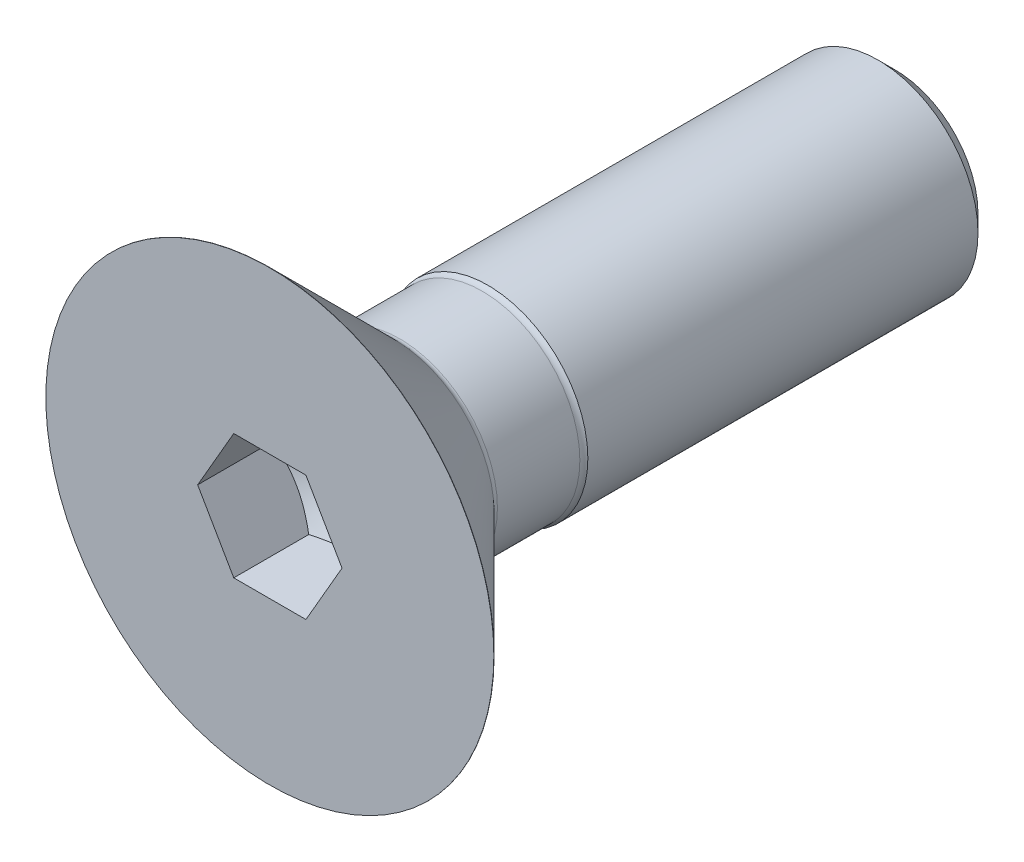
ISO-10303-21;
HEADER;
FILE_DESCRIPTION(('STEP AP214'),'2;1');
FILE_NAME('part.step','',(''),(''),'','','');
FILE_SCHEMA(('AUTOMOTIVE_DESIGN { 1 0 10303 214 1 1 1 1 }'));
ENDSEC;
DATA;
#1=APPLICATION_CONTEXT('core data for automotive mechanical design processes');
#2=APPLICATION_PROTOCOL_DEFINITION('international standard','automotive_design',2000,#1);
#3=PRODUCT_CONTEXT('',#1,'mechanical');
#4=PRODUCT('Part','Part','',(#3));
#5=PRODUCT_RELATED_PRODUCT_CATEGORY('part','',(#4));
#6=PRODUCT_DEFINITION_FORMATION('','',#4);
#7=PRODUCT_DEFINITION_CONTEXT('part definition',#1,'design');
#8=PRODUCT_DEFINITION('design','',#6,#7);
#9=PRODUCT_DEFINITION_SHAPE('','',#8);
#10=(LENGTH_UNIT() NAMED_UNIT(*) SI_UNIT(.MILLI.,.METRE.));
#11=(NAMED_UNIT(*) PLANE_ANGLE_UNIT() SI_UNIT($,.RADIAN.));
#12=(NAMED_UNIT(*) SI_UNIT($,.STERADIAN.) SOLID_ANGLE_UNIT());
#13=UNCERTAINTY_MEASURE_WITH_UNIT(LENGTH_MEASURE(1.E-05),#10,'distance_accuracy_value','');
#14=(GEOMETRIC_REPRESENTATION_CONTEXT(3) GLOBAL_UNCERTAINTY_ASSIGNED_CONTEXT((#13)) GLOBAL_UNIT_ASSIGNED_CONTEXT((#10,
#11,#12)) REPRESENTATION_CONTEXT('',''));
#15=CARTESIAN_POINT('',(0.,0.,0.));
#16=DIRECTION('',(0.,0.,1.));
#17=DIRECTION('',(1.,0.,0.));
#18=AXIS2_PLACEMENT_3D('',#15,#16,#17);
#19=CARTESIAN_POINT('',(0.,8.96,0.));
#20=DIRECTION('',(0.,0.,-1.));
#21=DIRECTION('',(-1.,0.,0.));
#22=AXIS2_PLACEMENT_3D('',#19,#20,#21);
#23=PLANE('',#22);
#24=CARTESIAN_POINT('',(0.,0.,0.));
#25=DIRECTION('',(0.,0.,1.));
#26=DIRECTION('',(1.,0.,0.));
#27=AXIS2_PLACEMENT_3D('',#24,#25,#26);
#28=CIRCLE('',#27,8.96);
#29=CARTESIAN_POINT('',(8.96,0.,0.));
#30=VERTEX_POINT('',#29);
#31=EDGE_CURVE('E106',#30,#30,#28,.T.);
#32=ORIENTED_EDGE('',*,*,#31,.T.);
#33=EDGE_LOOP('',(#32));
#34=FACE_BOUND('',#33,.T.);
#35=DIRECTION('',(0.5,-0.866025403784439,0.));
#36=VECTOR('',#35,1.);
#37=CARTESIAN_POINT('',(1.443375,2.49999883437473,0.));
#38=LINE('',#37,#36);
#39=CARTESIAN_POINT('',(1.443375,2.49999883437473,0.));
#40=VERTEX_POINT('',#39);
#41=CARTESIAN_POINT('',(2.88675,0.,0.));
#42=VERTEX_POINT('',#41);
#43=EDGE_CURVE('E30',#40,#42,#38,.T.);
#44=ORIENTED_EDGE('',*,*,#43,.T.);
#45=DIRECTION('',(-0.5,-0.866025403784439,0.));
#46=VECTOR('',#45,1.);
#47=CARTESIAN_POINT('',(2.88675,0.,0.));
#48=LINE('',#47,#46);
#49=CARTESIAN_POINT('',(1.443375,-2.49999883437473,0.));
#50=VERTEX_POINT('',#49);
#51=EDGE_CURVE('E182',#42,#50,#48,.T.);
#52=ORIENTED_EDGE('',*,*,#51,.T.);
#53=DIRECTION('',(-1.,0.,0.));
#54=VECTOR('',#53,1.);
#55=CARTESIAN_POINT('',(1.443375,-2.49999883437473,0.));
#56=LINE('',#55,#54);
#57=CARTESIAN_POINT('',(-1.443375,-2.49999883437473,0.));
#58=VERTEX_POINT('',#57);
#59=EDGE_CURVE('E237',#50,#58,#56,.T.);
#60=ORIENTED_EDGE('',*,*,#59,.T.);
#61=DIRECTION('',(-0.5,0.866025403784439,0.));
#62=VECTOR('',#61,1.);
#63=CARTESIAN_POINT('',(-1.443375,-2.49999883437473,0.));
#64=LINE('',#63,#62);
#65=CARTESIAN_POINT('',(-2.88675,0.,0.));
#66=VERTEX_POINT('',#65);
#67=EDGE_CURVE('E235',#58,#66,#64,.T.);
#68=ORIENTED_EDGE('',*,*,#67,.T.);
#69=DIRECTION('',(0.5,0.866025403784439,0.));
#70=VECTOR('',#69,1.);
#71=CARTESIAN_POINT('',(-2.88675,0.,0.));
#72=LINE('',#71,#70);
#73=CARTESIAN_POINT('',(-1.443375,2.49999883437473,0.));
#74=VERTEX_POINT('',#73);
#75=EDGE_CURVE('E95',#66,#74,#72,.T.);
#76=ORIENTED_EDGE('',*,*,#75,.T.);
#77=DIRECTION('',(1.,0.,0.));
#78=VECTOR('',#77,1.);
#79=CARTESIAN_POINT('',(-1.443375,2.49999883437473,0.));
#80=LINE('',#79,#78);
#81=EDGE_CURVE('E91',#74,#40,#80,.T.);
#82=ORIENTED_EDGE('',*,*,#81,.T.);
#83=EDGE_LOOP('',(#44,#52,#60,#68,#76,#82));
#84=FACE_BOUND('',#83,.T.);
#85=ADVANCED_FACE('F16',(#34,#84),#23,.F.);
#86=CARTESIAN_POINT('',(0.,0.,-25.));
#87=DIRECTION('',(0.,0.,1.));
#88=DIRECTION('',(1.,0.,0.));
#89=AXIS2_PLACEMENT_3D('',#86,#87,#88);
#90=PLANE('',#89);
#91=CARTESIAN_POINT('',(0.,0.,-25.));
#92=DIRECTION('',(0.,0.,1.));
#93=DIRECTION('',(1.,0.,0.));
#94=AXIS2_PLACEMENT_3D('',#91,#92,#93);
#95=CIRCLE('',#94,3.3234375);
#96=CARTESIAN_POINT('',(3.3234375,0.,-25.));
#97=VERTEX_POINT('',#96);
#98=EDGE_CURVE('E11',#97,#97,#95,.T.);
#99=ORIENTED_EDGE('',*,*,#98,.F.);
#100=EDGE_LOOP('',(#99));
#101=FACE_BOUND('',#100,.T.);
#102=ADVANCED_FACE('F131',(#101),#90,.F.);
#103=CARTESIAN_POINT('',(0.,0.,-25.));
#104=DIRECTION('',(0.,0.,1.));
#105=DIRECTION('',(1.,0.,0.));
#106=AXIS2_PLACEMENT_3D('',#103,#104,#105);
#107=CONICAL_SURFACE('',#106,3.3234375,0.785398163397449);
#108=CARTESIAN_POINT('',(0.,0.,-24.3234375));
#109=DIRECTION('',(0.,0.,1.));
#110=DIRECTION('',(1.,0.,0.));
#111=AXIS2_PLACEMENT_3D('',#108,#109,#110);
#112=CIRCLE('',#111,4.);
#113=CARTESIAN_POINT('',(4.,0.,-24.3234375));
#114=VERTEX_POINT('',#113);
#115=EDGE_CURVE('E23',#114,#114,#112,.T.);
#116=ORIENTED_EDGE('',*,*,#115,.F.);
#117=EDGE_LOOP('',(#116));
#118=FACE_BOUND('',#117,.T.);
#119=ORIENTED_EDGE('',*,*,#98,.T.);
#120=EDGE_LOOP('',(#119));
#121=FACE_BOUND('',#120,.T.);
#122=ADVANCED_FACE('F128',(#118,#121),#107,.T.);
#123=CARTESIAN_POINT('',(0.,0.,0.));
#124=DIRECTION('',(0.,0.,1.));
#125=DIRECTION('',(1.,0.,0.));
#126=AXIS2_PLACEMENT_3D('',#123,#124,#125);
#127=CYLINDRICAL_SURFACE('',#126,4.);
#128=CARTESIAN_POINT('',(0.,0.,-8.72));
#129=DIRECTION('',(0.,0.,1.));
#130=DIRECTION('',(1.,0.,0.));
#131=AXIS2_PLACEMENT_3D('',#128,#129,#130);
#132=CIRCLE('',#131,4.);
#133=CARTESIAN_POINT('',(4.,0.,-8.72));
#134=VERTEX_POINT('',#133);
#135=EDGE_CURVE('E121',#134,#134,#132,.T.);
#136=ORIENTED_EDGE('',*,*,#135,.F.);
#137=EDGE_LOOP('',(#136));
#138=FACE_BOUND('',#137,.T.);
#139=ORIENTED_EDGE('',*,*,#115,.T.);
#140=EDGE_LOOP('',(#139));
#141=FACE_BOUND('',#140,.T.);
#142=ADVANCED_FACE('F126',(#138,#141),#127,.T.);
#143=CARTESIAN_POINT('',(0.,0.,-8.49372583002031));
#144=DIRECTION('',(0.,0.,1.));
#145=DIRECTION('',(1.,0.,0.));
#146=AXIS2_PLACEMENT_3D('',#143,#144,#145);
#147=TOROIDAL_SURFACE('',#146,4.2262741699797,0.32);
#148=ORIENTED_EDGE('',*,*,#135,.T.);
#149=EDGE_LOOP('',(#148));
#150=FACE_BOUND('',#149,.T.);
#151=CARTESIAN_POINT('',(0.,0.,-8.49372583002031));
#152=DIRECTION('',(0.,0.,1.));
#153=DIRECTION('',(1.,0.,0.));
#154=AXIS2_PLACEMENT_3D('',#151,#152,#153);
#155=CIRCLE('',#154,3.9062741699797);
#156=CARTESIAN_POINT('',(3.9062741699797,0.,-8.49372583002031));
#157=VERTEX_POINT('',#156);
#158=EDGE_CURVE('E118',#157,#157,#155,.T.);
#159=ORIENTED_EDGE('',*,*,#158,.F.);
#160=EDGE_LOOP('',(#159));
#161=FACE_BOUND('',#160,.T.);
#162=ADVANCED_FACE('F144',(#150,#161),#147,.F.);
#163=CARTESIAN_POINT('',(0.,0.,0.));
#164=DIRECTION('',(0.,0.,1.));
#165=DIRECTION('',(1.,0.,0.));
#166=AXIS2_PLACEMENT_3D('',#163,#164,#165);
#167=CYLINDRICAL_SURFACE('',#166,3.9062741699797);
#168=CARTESIAN_POINT('',(0.,0.,-5.19627416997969));
#169=DIRECTION('',(0.,0.,1.));
#170=DIRECTION('',(1.,0.,0.));
#171=AXIS2_PLACEMENT_3D('',#168,#169,#170);
#172=CIRCLE('',#171,3.9062741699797);
#173=CARTESIAN_POINT('',(3.9062741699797,0.,-5.19627416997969));
#174=VERTEX_POINT('',#173);
#175=EDGE_CURVE('E115',#174,#174,#172,.T.);
#176=ORIENTED_EDGE('',*,*,#175,.F.);
#177=EDGE_LOOP('',(#176));
#178=FACE_BOUND('',#177,.T.);
#179=ORIENTED_EDGE('',*,*,#158,.T.);
#180=EDGE_LOOP('',(#179));
#181=FACE_BOUND('',#180,.T.);
#182=ADVANCED_FACE('F148',(#178,#181),#167,.T.);
#183=CARTESIAN_POINT('',(0.,0.,-5.19627416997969));
#184=DIRECTION('',(0.,0.,1.));
#185=DIRECTION('',(1.,0.,0.));
#186=AXIS2_PLACEMENT_3D('',#183,#184,#185);
#187=TOROIDAL_SURFACE('',#186,4.22627416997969,0.32);
#188=ORIENTED_EDGE('',*,*,#175,.T.);
#189=EDGE_LOOP('',(#188));
#190=FACE_BOUND('',#189,.T.);
#191=CARTESIAN_POINT('',(0.,0.,-4.97));
#192=DIRECTION('',(0.,0.,1.));
#193=DIRECTION('',(1.,0.,0.));
#194=AXIS2_PLACEMENT_3D('',#191,#192,#193);
#195=CIRCLE('',#194,4.);
#196=CARTESIAN_POINT('',(4.,0.,-4.97));
#197=VERTEX_POINT('',#196);
#198=EDGE_CURVE('E112',#197,#197,#195,.T.);
#199=ORIENTED_EDGE('',*,*,#198,.F.);
#200=EDGE_LOOP('',(#199));
#201=FACE_BOUND('',#200,.T.);
#202=ADVANCED_FACE('F152',(#190,#201),#187,.F.);
#203=CARTESIAN_POINT('',(0.,0.,-4.97));
#204=DIRECTION('',(0.,0.,1.));
#205=DIRECTION('',(1.,0.,0.));
#206=AXIS2_PLACEMENT_3D('',#203,#204,#205);
#207=CONICAL_SURFACE('',#206,4.,0.785398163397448);
#208=CARTESIAN_POINT('',(0.,0.,-0.0099999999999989));
#209=DIRECTION('',(0.,0.,1.));
#210=DIRECTION('',(1.,0.,0.));
#211=AXIS2_PLACEMENT_3D('',#208,#209,#210);
#212=CIRCLE('',#211,8.96);
#213=CARTESIAN_POINT('',(8.96,0.,-0.00999999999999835));
#214=VERTEX_POINT('',#213);
#215=EDGE_CURVE('E109',#214,#214,#212,.T.);
#216=ORIENTED_EDGE('',*,*,#215,.F.);
#217=EDGE_LOOP('',(#216));
#218=FACE_BOUND('',#217,.T.);
#219=ORIENTED_EDGE('',*,*,#198,.T.);
#220=EDGE_LOOP('',(#219));
#221=FACE_BOUND('',#220,.T.);
#222=ADVANCED_FACE('F156',(#218,#221),#207,.T.);
#223=CARTESIAN_POINT('',(0.,0.,0.));
#224=DIRECTION('',(0.,0.,1.));
#225=DIRECTION('',(1.,0.,0.));
#226=AXIS2_PLACEMENT_3D('',#223,#224,#225);
#227=CYLINDRICAL_SURFACE('',#226,8.96);
#228=ORIENTED_EDGE('',*,*,#31,.F.);
#229=EDGE_LOOP('',(#228));
#230=FACE_BOUND('',#229,.T.);
#231=ORIENTED_EDGE('',*,*,#215,.T.);
#232=EDGE_LOOP('',(#231));
#233=FACE_BOUND('',#232,.T.);
#234=ADVANCED_FACE('F160',(#230,#233),#227,.T.);
#235=CARTESIAN_POINT('',(1.443375,2.49999883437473,-4.66666588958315));
#236=DIRECTION('',(-0.866025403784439,-0.5,0.));
#237=DIRECTION('',(-0.5,0.866025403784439,0.));
#238=AXIS2_PLACEMENT_3D('',#235,#236,#237);
#239=PLANE('',#238);
#240=DIRECTION('',(0.,0.,1.));
#241=VECTOR('',#240,1.);
#242=CARTESIAN_POINT('',(2.88675,0.,-4.66666588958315));
#243=LINE('',#242,#241);
#244=CARTESIAN_POINT('',(2.88675,0.,-3.));
#245=VERTEX_POINT('',#244);
#246=EDGE_CURVE('E104',#245,#42,#243,.T.);
#247=ORIENTED_EDGE('',*,*,#246,.T.);
#248=ORIENTED_EDGE('',*,*,#43,.F.);
#249=DIRECTION('',(0.,0.,1.));
#250=VECTOR('',#249,1.);
#251=CARTESIAN_POINT('',(1.443375,2.49999883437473,-4.66666588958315));
#252=LINE('',#251,#250);
#253=CARTESIAN_POINT('',(1.443375,2.49999883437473,-3.));
#254=VERTEX_POINT('',#253);
#255=EDGE_CURVE('E85',#254,#40,#252,.T.);
#256=ORIENTED_EDGE('',*,*,#255,.F.);
#257=CARTESIAN_POINT('',(2.88675011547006,-1.99999999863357E-07,-2.99999993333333));
#258=CARTESIAN_POINT('',(2.82332252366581,0.10985961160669,-3.03663049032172));
#259=CARTESIAN_POINT('',(2.75934742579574,0.220667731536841,-3.06994406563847));
#260=CARTESIAN_POINT('',(2.63028954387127,0.444202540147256,-3.12809191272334));
#261=CARTESIAN_POINT('',(2.56520446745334,0.556933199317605,-3.15290561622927));
#262=CARTESIAN_POINT('',(2.43584088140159,0.780997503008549,-3.19152993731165));
#263=CARTESIAN_POINT('',(2.37158227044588,0.892296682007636,-3.20559765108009));
#264=CARTESIAN_POINT('',(2.24276284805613,1.11541846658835,-3.22238842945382));
#265=CARTESIAN_POINT('',(2.17820250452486,1.22724026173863,-3.22512540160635));
#266=CARTESIAN_POINT('',(2.05757841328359,1.43616731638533,-3.21941704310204));
#267=CARTESIAN_POINT('',(2.00149656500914,1.53330392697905,-3.2123733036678));
#268=CARTESIAN_POINT('',(1.8896982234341,1.72694433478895,-3.19005329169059));
#269=CARTESIAN_POINT('',(1.83398211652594,1.82344746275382,-3.17476940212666));
#270=CARTESIAN_POINT('',(1.72195345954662,2.01748678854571,-3.13656263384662));
#271=CARTESIAN_POINT('',(1.66565508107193,2.11499844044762,-3.11347787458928));
#272=CARTESIAN_POINT('',(1.55389777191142,2.3085677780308,-3.06108522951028));
#273=CARTESIAN_POINT('',(1.49843741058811,2.40462794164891,-3.03178964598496));
#274=CARTESIAN_POINT('',(1.44337488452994,2.49999903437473,-2.99999993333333));
#275=B_SPLINE_CURVE_WITH_KNOTS('',3,(#257,#258,#259,#260,#261,#262,#263,#264,#265,#266,#267,
#268,#269,#270,#271,#272,#273,#274),.UNSPECIFIED.,.F.,.F.,(4,2,2,2,2,2,2,2,4),(0.,
0.396269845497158,0.793491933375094,1.18088400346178,1.56780044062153,1.90463400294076,
2.24177946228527,2.58640119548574,2.93034658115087),.UNSPECIFIED.);
#276=EDGE_CURVE('E78',#245,#254,#275,.T.);
#277=ORIENTED_EDGE('',*,*,#276,.F.);
#278=EDGE_LOOP('',(#247,#248,#256,#277));
#279=FACE_BOUND('',#278,.T.);
#280=ADVANCED_FACE('F86',(#279),#239,.T.);
#281=CARTESIAN_POINT('',(2.88675,0.,-4.66666588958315));
#282=DIRECTION('',(-0.866025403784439,0.5,0.));
#283=DIRECTION('',(0.5,0.866025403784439,0.));
#284=AXIS2_PLACEMENT_3D('',#281,#282,#283);
#285=PLANE('',#284);
#286=DIRECTION('',(0.,0.,1.));
#287=VECTOR('',#286,1.);
#288=CARTESIAN_POINT('',(1.443375,-2.49999883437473,-4.66666588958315));
#289=LINE('',#288,#287);
#290=CARTESIAN_POINT('',(1.443375,-2.49999883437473,-3.));
#291=VERTEX_POINT('',#290);
#292=EDGE_CURVE('E102',#291,#50,#289,.T.);
#293=ORIENTED_EDGE('',*,*,#292,.T.);
#294=ORIENTED_EDGE('',*,*,#51,.F.);
#295=ORIENTED_EDGE('',*,*,#246,.F.);
#296=CARTESIAN_POINT('',(1.44337488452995,-2.49999903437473,-2.99999993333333));
#297=CARTESIAN_POINT('',(1.50680247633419,-2.39013922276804,-3.03663049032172));
#298=CARTESIAN_POINT('',(1.57077757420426,-2.27933110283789,-3.06994406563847));
#299=CARTESIAN_POINT('',(1.69983545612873,-2.05579629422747,-3.12809191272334));
#300=CARTESIAN_POINT('',(1.76492053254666,-1.94306563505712,-3.15290561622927));
#301=CARTESIAN_POINT('',(1.89428411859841,-1.71900133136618,-3.19152993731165));
#302=CARTESIAN_POINT('',(1.95854272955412,-1.60770215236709,-3.20559765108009));
#303=CARTESIAN_POINT('',(2.08736215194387,-1.38458036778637,-3.22238842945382));
#304=CARTESIAN_POINT('',(2.15192249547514,-1.2727585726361,-3.22512540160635));
#305=CARTESIAN_POINT('',(2.27254658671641,-1.06383151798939,-3.21941704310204));
#306=CARTESIAN_POINT('',(2.32862843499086,-0.966694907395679,-3.2123733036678));
#307=CARTESIAN_POINT('',(2.4404267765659,-0.77305449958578,-3.19005329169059));
#308=CARTESIAN_POINT('',(2.49614288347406,-0.676551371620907,-3.17476940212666));
#309=CARTESIAN_POINT('',(2.60817154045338,-0.48251204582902,-3.13656263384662));
#310=CARTESIAN_POINT('',(2.66446991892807,-0.385000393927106,-3.11347787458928));
#311=CARTESIAN_POINT('',(2.77622722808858,-0.191431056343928,-3.06108522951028));
#312=CARTESIAN_POINT('',(2.83168758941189,-0.0953708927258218,-3.03178964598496));
#313=CARTESIAN_POINT('',(2.88675011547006,1.99999999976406E-07,-2.99999993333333));
#314=B_SPLINE_CURVE_WITH_KNOTS('',3,(#296,#297,#298,#299,#300,#301,#302,#303,#304,#305,#306,
#307,#308,#309,#310,#311,#312,#313),.UNSPECIFIED.,.F.,.F.,(4,2,2,2,2,2,2,2,4),(0.,
0.396269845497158,0.793491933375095,1.18088400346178,1.56780044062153,1.90463400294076,
2.24177946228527,2.58640119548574,2.93034658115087),.UNSPECIFIED.);
#315=EDGE_CURVE('E82',#291,#245,#314,.T.);
#316=ORIENTED_EDGE('',*,*,#315,.F.);
#317=EDGE_LOOP('',(#293,#294,#295,#316));
#318=FACE_BOUND('',#317,.T.);
#319=ADVANCED_FACE('F168',(#318),#285,.T.);
#320=CARTESIAN_POINT('',(1.443375,-2.49999883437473,-4.66666588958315));
#321=DIRECTION('',(0.,1.,0.));
#322=DIRECTION('',(1.,0.,0.));
#323=AXIS2_PLACEMENT_3D('',#320,#321,#322);
#324=PLANE('',#323);
#325=DIRECTION('',(0.,0.,1.));
#326=VECTOR('',#325,1.);
#327=CARTESIAN_POINT('',(-1.443375,-2.49999883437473,-4.66666588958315));
#328=LINE('',#327,#326);
#329=CARTESIAN_POINT('',(-1.443375,-2.49999883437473,-3.));
#330=VERTEX_POINT('',#329);
#331=EDGE_CURVE('E100',#330,#58,#328,.T.);
#332=ORIENTED_EDGE('',*,*,#331,.T.);
#333=ORIENTED_EDGE('',*,*,#59,.F.);
#334=ORIENTED_EDGE('',*,*,#292,.F.);
#335=CARTESIAN_POINT('',(-3.73786106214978,-2.49999883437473,-2.07041221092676));
#336=CARTESIAN_POINT('',(-3.62990250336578,-2.49999883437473,-2.12220664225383));
#337=CARTESIAN_POINT('',(-3.52168094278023,-2.49999883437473,-2.17346309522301));
#338=CARTESIAN_POINT('',(-3.30457164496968,-2.49999883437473,-2.27459485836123));
#339=CARTESIAN_POINT('',(-3.1956837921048,-2.49999883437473,-2.32446991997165));
#340=CARTESIAN_POINT('',(-2.97647740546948,-2.49999883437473,-2.42281234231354));
#341=CARTESIAN_POINT('',(-2.86615419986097,-2.49999883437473,-2.4712693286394));
#342=CARTESIAN_POINT('',(-2.64458202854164,-2.49999883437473,-2.56601036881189));
#343=CARTESIAN_POINT('',(-2.5333331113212,-2.49999883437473,-2.61229453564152));
#344=CARTESIAN_POINT('',(-2.30680205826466,-2.49999883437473,-2.70328992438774));
#345=CARTESIAN_POINT('',(-2.19149052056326,-2.49999883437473,-2.74792838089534));
#346=CARTESIAN_POINT('',(-1.95947266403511,-2.49999883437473,-2.83349401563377));
#347=CARTESIAN_POINT('',(-1.84276618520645,-2.49999883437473,-2.87442076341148));
#348=CARTESIAN_POINT('',(-1.60804233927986,-2.49999883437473,-2.95139260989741));
#349=CARTESIAN_POINT('',(-1.49002871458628,-2.49999883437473,-2.98744899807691));
#350=CARTESIAN_POINT('',(-1.25231014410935,-2.49999883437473,-3.05344705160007));
#351=CARTESIAN_POINT('',(-1.13260562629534,-2.49999883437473,-3.08339023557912));
#352=CARTESIAN_POINT('',(-0.891754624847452,-2.49999883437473,-3.13556568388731));
#353=CARTESIAN_POINT('',(-0.770611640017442,-2.49999883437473,-3.15781378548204));
#354=CARTESIAN_POINT('',(-0.526970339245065,-2.49999883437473,-3.19314222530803));
#355=CARTESIAN_POINT('',(-0.404472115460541,-2.49999883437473,-3.20622318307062));
#356=CARTESIAN_POINT('',(-0.160266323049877,-2.49999883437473,-3.22200367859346));
#357=CARTESIAN_POINT('',(-0.0385668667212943,-2.49999883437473,-3.2248257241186));
#358=CARTESIAN_POINT('',(0.204641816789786,-2.49999883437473,-3.22016410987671));
#359=CARTESIAN_POINT('',(0.326151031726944,-2.49999883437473,-3.21267981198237));
#360=CARTESIAN_POINT('',(0.536550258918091,-2.49999883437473,-3.19130128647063));
#361=CARTESIAN_POINT('',(0.62567290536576,-2.49999883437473,-3.17959110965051));
#362=CARTESIAN_POINT('',(0.803172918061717,-2.49999883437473,-3.15143172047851));
#363=CARTESIAN_POINT('',(0.891550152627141,-2.49999883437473,-3.13498168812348));
#364=CARTESIAN_POINT('',(1.15551819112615,-2.49999883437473,-3.07939182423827));
#365=CARTESIAN_POINT('',(1.32980784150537,-2.49999883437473,-3.03402791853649));
#366=CARTESIAN_POINT('',(1.59042319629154,-2.49999883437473,-2.95652590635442));
#367=CARTESIAN_POINT('',(1.67812270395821,-2.49999883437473,-2.92875434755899));
#368=CARTESIAN_POINT('',(1.85261386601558,-2.49999883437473,-2.87064301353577));
#369=CARTESIAN_POINT('',(1.93940604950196,-2.49999883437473,-2.84030484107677));
#370=CARTESIAN_POINT('',(2.11219208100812,-2.49999883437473,-2.77749987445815));
#371=CARTESIAN_POINT('',(2.19818607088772,-2.49999883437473,-2.74503346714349));
#372=CARTESIAN_POINT('',(2.36949689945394,-2.49999883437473,-2.67832369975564));
#373=CARTESIAN_POINT('',(2.45481362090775,-2.49999883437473,-2.6440800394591));
#374=CARTESIAN_POINT('',(2.67258663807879,-2.49999883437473,-2.55447752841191));
#375=CARTESIAN_POINT('',(2.80460718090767,-2.49999883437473,-2.49806097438));
#376=CARTESIAN_POINT('',(3.06745885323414,-2.49999883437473,-2.38251374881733));
#377=CARTESIAN_POINT('',(3.19828989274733,-2.49999883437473,-2.32338287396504));
#378=CARTESIAN_POINT('',(3.45900849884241,-2.49999883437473,-2.20302339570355));
#379=CARTESIAN_POINT('',(3.58889589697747,-2.49999883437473,-2.14179442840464));
#380=CARTESIAN_POINT('',(3.84788845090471,-2.49999883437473,-2.01770131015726));
#381=CARTESIAN_POINT('',(3.97699358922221,-2.49999883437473,-1.95483712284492));
#382=CARTESIAN_POINT('',(4.36366789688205,-2.49999883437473,-1.7641683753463));
#383=CARTESIAN_POINT('',(4.62028438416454,-2.49999883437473,-1.63443362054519));
#384=CARTESIAN_POINT('',(5.1317603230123,-2.49999883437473,-1.37164618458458));
#385=CARTESIAN_POINT('',(5.38661999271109,-2.49999883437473,-1.23859392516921));
#386=CARTESIAN_POINT('',(5.87112445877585,-2.49999883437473,-0.982853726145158));
#387=CARTESIAN_POINT('',(6.10087872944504,-2.49999883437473,-0.860372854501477));
#388=CARTESIAN_POINT('',(6.55964828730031,-2.49999883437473,-0.614016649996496));
#389=CARTESIAN_POINT('',(6.78866354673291,-2.49999883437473,-0.490141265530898));
#390=CARTESIAN_POINT('',(7.24554286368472,-2.49999883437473,-0.241661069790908));
#391=CARTESIAN_POINT('',(7.47340836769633,-2.49999883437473,-0.117058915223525));
#392=CARTESIAN_POINT('',(7.92867868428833,-2.49999883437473,0.132956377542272));
#393=CARTESIAN_POINT('',(8.15608352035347,-2.49999883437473,0.258369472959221));
#394=CARTESIAN_POINT('',(8.38332285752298,-2.49999883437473,0.384079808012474));
#395=B_SPLINE_CURVE_WITH_KNOTS('',3,(#335,#336,#337,#338,#339,#340,#341,#342,#343,#344,#345,
#346,#347,#348,#349,#350,#351,#352,#353,#354,#355,#356,#357,#358,#359,#360,#361,#362,#363,#364,
#365,#366,#367,#368,#369,#370,#371,#372,#373,#374,#375,#376,#377,#378,#379,#380,#381,#382,#383,
#384,#385,#386,#387,#388,#389,#390,#391,#392,#393,#394),.UNSPECIFIED.,.F.,.F.,(4,2,2,2,2,2,2,2,
2,2,2,2,2,2,2,2,2,2,2,2,2,2,2,2,2,2,2,2,2,4),(0.,0.359225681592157,0.718515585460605,
1.07998495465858,1.44143550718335,1.81233642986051,2.18328031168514,2.55334902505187,
2.92332569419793,3.29253631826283,3.66172198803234,4.02648423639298,4.39126907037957,
4.66080188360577,4.93038135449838,5.46995360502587,5.74590907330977,6.02169347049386,
6.29742787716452,6.5732090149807,7.00387398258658,7.43457126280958,7.86534362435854,
8.29612557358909,9.15872149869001,10.0212083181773,10.8022890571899,11.583398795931,
12.3625217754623,13.1416039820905),.UNSPECIFIED.);
#396=EDGE_CURVE('E210',#330,#291,#395,.T.);
#397=ORIENTED_EDGE('',*,*,#396,.F.);
#398=EDGE_LOOP('',(#332,#333,#334,#397));
#399=FACE_BOUND('',#398,.T.);
#400=ADVANCED_FACE('F215',(#399),#324,.T.);
#401=CARTESIAN_POINT('',(-1.443375,-2.49999883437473,-4.66666588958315));
#402=DIRECTION('',(0.866025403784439,0.5,0.));
#403=DIRECTION('',(0.5,-0.866025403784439,0.));
#404=AXIS2_PLACEMENT_3D('',#401,#402,#403);
#405=PLANE('',#404);
#406=DIRECTION('',(0.,0.,1.));
#407=VECTOR('',#406,1.);
#408=CARTESIAN_POINT('',(-2.88675,0.,-4.66666588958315));
#409=LINE('',#408,#407);
#410=CARTESIAN_POINT('',(-2.88675,0.,-3.));
#411=VERTEX_POINT('',#410);
#412=EDGE_CURVE('E93',#411,#66,#409,.T.);
#413=ORIENTED_EDGE('',*,*,#412,.T.);
#414=ORIENTED_EDGE('',*,*,#67,.F.);
#415=ORIENTED_EDGE('',*,*,#331,.F.);
#416=CARTESIAN_POINT('',(-2.88675011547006,2.E-07,-2.99999993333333));
#417=CARTESIAN_POINT('',(-2.82332252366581,-0.10985961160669,-3.03663049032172));
#418=CARTESIAN_POINT('',(-2.75934742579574,-0.220667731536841,-3.06994406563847));
#419=CARTESIAN_POINT('',(-2.63028954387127,-0.444202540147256,-3.12809191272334));
#420=CARTESIAN_POINT('',(-2.56520446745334,-0.556933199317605,-3.15290561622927));
#421=CARTESIAN_POINT('',(-2.43584088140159,-0.78099750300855,-3.19152993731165));
#422=CARTESIAN_POINT('',(-2.37158227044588,-0.892296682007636,-3.20559765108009));
#423=CARTESIAN_POINT('',(-2.24276284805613,-1.11541846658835,-3.22238842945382));
#424=CARTESIAN_POINT('',(-2.17820250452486,-1.22724026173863,-3.22512540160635));
#425=CARTESIAN_POINT('',(-2.05757841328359,-1.43616731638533,-3.21941704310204));
#426=CARTESIAN_POINT('',(-2.00149656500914,-1.53330392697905,-3.2123733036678));
#427=CARTESIAN_POINT('',(-1.8896982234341,-1.72694433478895,-3.19005329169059));
#428=CARTESIAN_POINT('',(-1.83398211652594,-1.82344746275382,-3.17476940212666));
#429=CARTESIAN_POINT('',(-1.72195345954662,-2.01748678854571,-3.13656263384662));
#430=CARTESIAN_POINT('',(-1.66565508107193,-2.11499844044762,-3.11347787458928));
#431=CARTESIAN_POINT('',(-1.55389777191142,-2.3085677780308,-3.06108522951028));
#432=CARTESIAN_POINT('',(-1.49843741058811,-2.40462794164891,-3.03178964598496));
#433=CARTESIAN_POINT('',(-1.44337488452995,-2.49999903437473,-2.99999993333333));
#434=B_SPLINE_CURVE_WITH_KNOTS('',3,(#416,#417,#418,#419,#420,#421,#422,#423,#424,#425,#426,
#427,#428,#429,#430,#431,#432,#433),.UNSPECIFIED.,.F.,.F.,(4,2,2,2,2,2,2,2,4),(0.,
0.396269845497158,0.793491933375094,1.18088400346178,1.56780044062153,1.90463400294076,
2.24177946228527,2.58640119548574,2.93034658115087),.UNSPECIFIED.);
#435=EDGE_CURVE('E204',#411,#330,#434,.T.);
#436=ORIENTED_EDGE('',*,*,#435,.F.);
#437=EDGE_LOOP('',(#413,#414,#415,#436));
#438=FACE_BOUND('',#437,.T.);
#439=ADVANCED_FACE('F218',(#438),#405,.T.);
#440=CARTESIAN_POINT('',(-2.88675,0.,-4.66666588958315));
#441=DIRECTION('',(0.866025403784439,-0.5,0.));
#442=DIRECTION('',(-0.5,-0.866025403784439,0.));
#443=AXIS2_PLACEMENT_3D('',#440,#441,#442);
#444=PLANE('',#443);
#445=DIRECTION('',(0.,0.,1.));
#446=VECTOR('',#445,1.);
#447=CARTESIAN_POINT('',(-1.443375,2.49999883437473,-4.66666588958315));
#448=LINE('',#447,#446);
#449=CARTESIAN_POINT('',(-1.443375,2.49999883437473,-3.));
#450=VERTEX_POINT('',#449);
#451=EDGE_CURVE('E90',#450,#74,#448,.T.);
#452=ORIENTED_EDGE('',*,*,#451,.T.);
#453=ORIENTED_EDGE('',*,*,#75,.F.);
#454=ORIENTED_EDGE('',*,*,#412,.F.);
#455=CARTESIAN_POINT('',(-1.44337488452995,2.49999903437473,-2.99999993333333));
#456=CARTESIAN_POINT('',(-1.50680247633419,2.39013922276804,-3.03663049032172));
#457=CARTESIAN_POINT('',(-1.57077757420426,2.27933110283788,-3.06994406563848));
#458=CARTESIAN_POINT('',(-1.69983545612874,2.05579629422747,-3.12809191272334));
#459=CARTESIAN_POINT('',(-1.76492053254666,1.94306563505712,-3.15290561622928));
#460=CARTESIAN_POINT('',(-1.89428411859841,1.71900133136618,-3.19152993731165));
#461=CARTESIAN_POINT('',(-1.95854272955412,1.60770215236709,-3.20559765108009));
#462=CARTESIAN_POINT('',(-2.08736215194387,1.38458036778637,-3.22238842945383));
#463=CARTESIAN_POINT('',(-2.15192249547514,1.2727585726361,-3.22512540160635));
#464=CARTESIAN_POINT('',(-2.27254658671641,1.06383151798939,-3.21941704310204));
#465=CARTESIAN_POINT('',(-2.32862843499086,0.966694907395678,-3.2123733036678));
#466=CARTESIAN_POINT('',(-2.4404267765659,0.773054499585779,-3.19005329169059));
#467=CARTESIAN_POINT('',(-2.49614288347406,0.676551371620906,-3.17476940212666));
#468=CARTESIAN_POINT('',(-2.60817154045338,0.48251204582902,-3.13656263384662));
#469=CARTESIAN_POINT('',(-2.66446991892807,0.385000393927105,-3.11347787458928));
#470=CARTESIAN_POINT('',(-2.77622722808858,0.191431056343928,-3.06108522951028));
#471=CARTESIAN_POINT('',(-2.83168758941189,0.0953708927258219,-3.03178964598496));
#472=CARTESIAN_POINT('',(-2.88675011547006,-2.00000000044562E-07,-2.99999993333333));
#473=B_SPLINE_CURVE_WITH_KNOTS('',3,(#455,#456,#457,#458,#459,#460,#461,#462,#463,#464,#465,
#466,#467,#468,#469,#470,#471,#472),.UNSPECIFIED.,.F.,.F.,(4,2,2,2,2,2,2,2,4),(0.,
0.396269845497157,0.793491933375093,1.18088400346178,1.56780044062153,1.90463400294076,
2.24177946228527,2.58640119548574,2.93034658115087),.UNSPECIFIED.);
#474=EDGE_CURVE('E38',#450,#411,#473,.T.);
#475=ORIENTED_EDGE('',*,*,#474,.F.);
#476=EDGE_LOOP('',(#452,#453,#454,#475));
#477=FACE_BOUND('',#476,.T.);
#478=ADVANCED_FACE('F222',(#477),#444,.T.);
#479=CARTESIAN_POINT('',(-1.443375,2.49999883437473,-4.66666588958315));
#480=DIRECTION('',(0.,-1.,0.));
#481=DIRECTION('',(-1.,0.,0.));
#482=AXIS2_PLACEMENT_3D('',#479,#480,#481);
#483=PLANE('',#482);
#484=ORIENTED_EDGE('',*,*,#255,.T.);
#485=ORIENTED_EDGE('',*,*,#81,.F.);
#486=ORIENTED_EDGE('',*,*,#451,.F.);
#487=CARTESIAN_POINT('',(-3.73786106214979,2.49999883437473,-2.07041221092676));
#488=CARTESIAN_POINT('',(-3.62990250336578,2.49999883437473,-2.12220664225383));
#489=CARTESIAN_POINT('',(-3.52168094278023,2.49999883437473,-2.17346309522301));
#490=CARTESIAN_POINT('',(-3.30457164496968,2.49999883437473,-2.27459485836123));
#491=CARTESIAN_POINT('',(-3.1956837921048,2.49999883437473,-2.32446991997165));
#492=CARTESIAN_POINT('',(-2.97647740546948,2.49999883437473,-2.42281234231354));
#493=CARTESIAN_POINT('',(-2.86615419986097,2.49999883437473,-2.4712693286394));
#494=CARTESIAN_POINT('',(-2.64458202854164,2.49999883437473,-2.56601036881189));
#495=CARTESIAN_POINT('',(-2.53333311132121,2.49999883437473,-2.61229453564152));
#496=CARTESIAN_POINT('',(-2.30680205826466,2.49999883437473,-2.70328992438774));
#497=CARTESIAN_POINT('',(-2.19149052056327,2.49999883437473,-2.74792838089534));
#498=CARTESIAN_POINT('',(-1.95947266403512,2.49999883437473,-2.83349401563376));
#499=CARTESIAN_POINT('',(-1.84276618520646,2.49999883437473,-2.87442076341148));
#500=CARTESIAN_POINT('',(-1.60804233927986,2.49999883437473,-2.95139260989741));
#501=CARTESIAN_POINT('',(-1.49002871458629,2.49999883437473,-2.98744899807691));
#502=CARTESIAN_POINT('',(-1.25231014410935,2.49999883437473,-3.05344705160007));
#503=CARTESIAN_POINT('',(-1.13260562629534,2.49999883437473,-3.08339023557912));
#504=CARTESIAN_POINT('',(-0.891754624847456,2.49999883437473,-3.13556568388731));
#505=CARTESIAN_POINT('',(-0.770611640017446,2.49999883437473,-3.15781378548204));
#506=CARTESIAN_POINT('',(-0.526970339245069,2.49999883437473,-3.19314222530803));
#507=CARTESIAN_POINT('',(-0.404472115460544,2.49999883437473,-3.20622318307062));
#508=CARTESIAN_POINT('',(-0.160266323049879,2.49999883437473,-3.22200367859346));
#509=CARTESIAN_POINT('',(-0.0385668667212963,2.49999883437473,-3.2248257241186));
#510=CARTESIAN_POINT('',(0.204641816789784,2.49999883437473,-3.22016410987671));
#511=CARTESIAN_POINT('',(0.326151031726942,2.49999883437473,-3.21267981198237));
#512=CARTESIAN_POINT('',(0.536550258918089,2.49999883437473,-3.19130128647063));
#513=CARTESIAN_POINT('',(0.625672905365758,2.49999883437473,-3.17959110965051));
#514=CARTESIAN_POINT('',(0.803172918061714,2.49999883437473,-3.15143172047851));
#515=CARTESIAN_POINT('',(0.891550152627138,2.49999883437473,-3.13498168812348));
#516=CARTESIAN_POINT('',(1.15551819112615,2.49999883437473,-3.07939182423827));
#517=CARTESIAN_POINT('',(1.32980784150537,2.49999883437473,-3.03402791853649));
#518=CARTESIAN_POINT('',(1.59042319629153,2.49999883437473,-2.95652590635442));
#519=CARTESIAN_POINT('',(1.67812270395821,2.49999883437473,-2.92875434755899));
#520=CARTESIAN_POINT('',(1.85261386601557,2.49999883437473,-2.87064301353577));
#521=CARTESIAN_POINT('',(1.93940604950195,2.49999883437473,-2.84030484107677));
#522=CARTESIAN_POINT('',(2.11219208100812,2.49999883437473,-2.77749987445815));
#523=CARTESIAN_POINT('',(2.19818607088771,2.49999883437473,-2.74503346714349));
#524=CARTESIAN_POINT('',(2.36949689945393,2.49999883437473,-2.67832369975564));
#525=CARTESIAN_POINT('',(2.45481362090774,2.49999883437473,-2.6440800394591));
#526=CARTESIAN_POINT('',(2.67258663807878,2.49999883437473,-2.55447752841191));
#527=CARTESIAN_POINT('',(2.80460718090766,2.49999883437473,-2.49806097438));
#528=CARTESIAN_POINT('',(3.06745885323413,2.49999883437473,-2.38251374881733));
#529=CARTESIAN_POINT('',(3.19828989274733,2.49999883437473,-2.32338287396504));
#530=CARTESIAN_POINT('',(3.4590084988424,2.49999883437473,-2.20302339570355));
#531=CARTESIAN_POINT('',(3.58889589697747,2.49999883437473,-2.14179442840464));
#532=CARTESIAN_POINT('',(3.84788845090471,2.49999883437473,-2.01770131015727));
#533=CARTESIAN_POINT('',(3.97699358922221,2.49999883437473,-1.95483712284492));
#534=CARTESIAN_POINT('',(4.36366789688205,2.49999883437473,-1.7641683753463));
#535=CARTESIAN_POINT('',(4.62028438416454,2.49999883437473,-1.63443362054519));
#536=CARTESIAN_POINT('',(5.1317603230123,2.49999883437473,-1.37164618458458));
#537=CARTESIAN_POINT('',(5.38661999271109,2.49999883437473,-1.23859392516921));
#538=CARTESIAN_POINT('',(5.87112445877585,2.49999883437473,-0.982853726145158));
#539=CARTESIAN_POINT('',(6.10087872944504,2.49999883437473,-0.860372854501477));
#540=CARTESIAN_POINT('',(6.5596482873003,2.49999883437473,-0.614016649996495));
#541=CARTESIAN_POINT('',(6.7886635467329,2.49999883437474,-0.490141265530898));
#542=CARTESIAN_POINT('',(7.24554286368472,2.49999883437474,-0.241661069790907));
#543=CARTESIAN_POINT('',(7.47340836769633,2.49999883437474,-0.117058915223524));
#544=CARTESIAN_POINT('',(7.92867868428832,2.49999883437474,0.132956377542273));
#545=CARTESIAN_POINT('',(8.15608352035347,2.49999883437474,0.258369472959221));
#546=CARTESIAN_POINT('',(8.38332285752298,2.49999883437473,0.384079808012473));
#547=B_SPLINE_CURVE_WITH_KNOTS('',3,(#487,#488,#489,#490,#491,#492,#493,#494,#495,#496,#497,
#498,#499,#500,#501,#502,#503,#504,#505,#506,#507,#508,#509,#510,#511,#512,#513,#514,#515,#516,
#517,#518,#519,#520,#521,#522,#523,#524,#525,#526,#527,#528,#529,#530,#531,#532,#533,#534,#535,
#536,#537,#538,#539,#540,#541,#542,#543,#544,#545,#546),.UNSPECIFIED.,.F.,.F.,(4,2,2,2,2,2,2,2,
2,2,2,2,2,2,2,2,2,2,2,2,2,2,2,2,2,2,2,2,2,4),(0.,0.359225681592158,0.718515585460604,
1.07998495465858,1.44143550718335,1.81233642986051,2.18328031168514,2.55334902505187,
2.92332569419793,3.29253631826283,3.66172198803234,4.02648423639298,4.39126907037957,
4.66080188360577,4.93038135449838,5.46995360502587,5.74590907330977,6.02169347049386,
6.29742787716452,6.5732090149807,7.00387398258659,7.43457126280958,7.86534362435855,
8.29612557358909,9.15872149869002,10.0212083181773,10.8022890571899,11.583398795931,
12.3625217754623,13.1416039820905),.UNSPECIFIED.);
#548=EDGE_CURVE('E79',#254,#450,#547,.F.);
#549=ORIENTED_EDGE('',*,*,#548,.F.);
#550=EDGE_LOOP('',(#484,#485,#486,#549));
#551=FACE_BOUND('',#550,.T.);
#552=ADVANCED_FACE('F74',(#551),#483,.T.);
#553=CARTESIAN_POINT('',(0.,0.,-4.66666588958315));
#554=DIRECTION('',(0.,0.,1.));
#555=DIRECTION('',(1.,0.,0.));
#556=AXIS2_PLACEMENT_3D('',#553,#554,#555);
#557=CONICAL_SURFACE('',#556,0.,1.0471975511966);
#558=CARTESIAN_POINT('',(0.,0.,-4.66666588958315));
#559=VERTEX_POINT('',#558);
#560=VERTEX_LOOP('',#559);
#561=FACE_BOUND('',#560,.T.);
#562=ORIENTED_EDGE('',*,*,#276,.T.);
#563=ORIENTED_EDGE('',*,*,#548,.T.);
#564=ORIENTED_EDGE('',*,*,#474,.T.);
#565=ORIENTED_EDGE('',*,*,#435,.T.);
#566=ORIENTED_EDGE('',*,*,#396,.T.);
#567=ORIENTED_EDGE('',*,*,#315,.T.);
#568=EDGE_LOOP('',(#562,#563,#564,#565,#566,#567));
#569=FACE_BOUND('',#568,.T.);
#570=ADVANCED_FACE('F71',(#561,#569),#557,.F.);
#571=CLOSED_SHELL('',(#85,#102,#122,#142,#162,#182,#202,#222,#234,#280,#319,#400,#439,#478,#552,#570));
#572=MANIFOLD_SOLID_BREP('B1',#571);
#573=ADVANCED_BREP_SHAPE_REPRESENTATION('',(#18,#572),#14);
#574=SHAPE_DEFINITION_REPRESENTATION(#9,#573);
ENDSEC;
END-ISO-10303-21;
